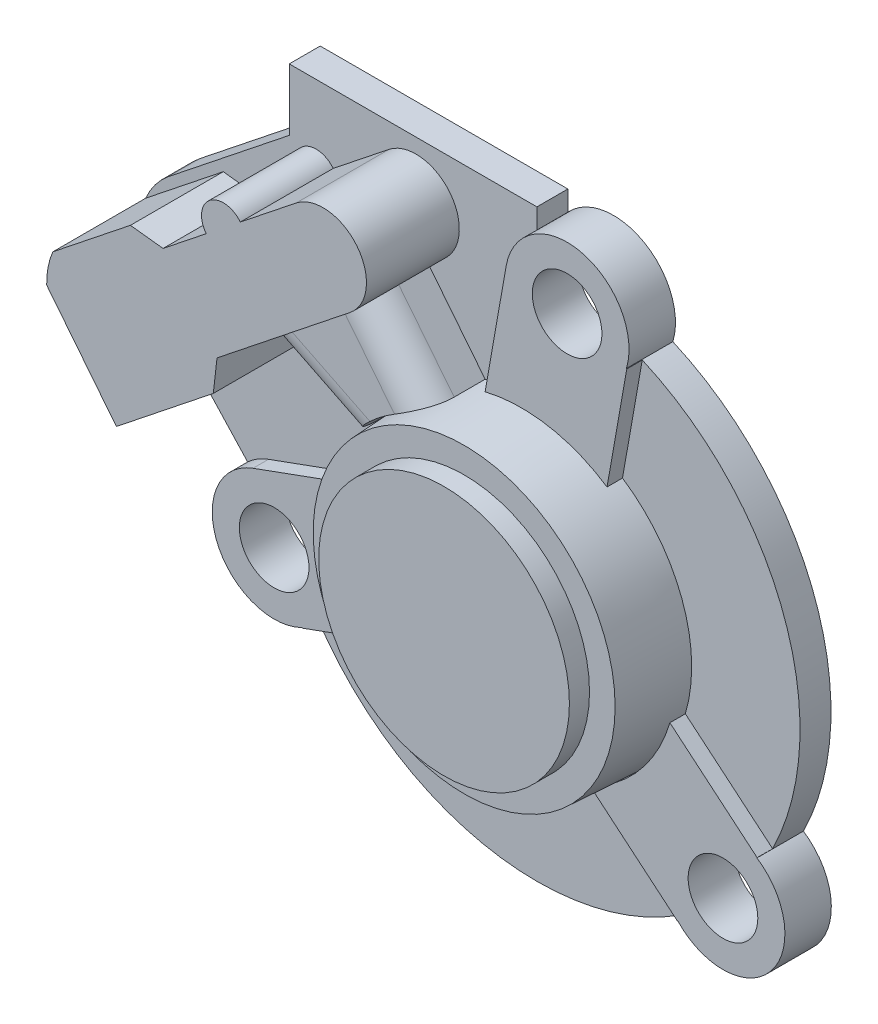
from build123d import *

# Parameters (mm, degrees)
EXTRUDE_1_DEPTH        = 2
SKETCH_2_R             = 10
EXTRUDE_2_DEPTH        = 4.7
EXTRUDE_2_TAPER        = 3
SKETCH_3_R             = 8.1
EXTRUDE_3_DEPTH        = 1.3
EXTRUDE_4_DEPTH        = 1
EXTRUDE_5_DEPTH        = 6
EXTRUDE_6_DEPTH        = 4
FILLET_1_R             = 2
HOLE_WIZARD_M4_1_D     = 4.5
HOLE_WIZARD_M4_1_DEPTH = 11.5
HOLE_WIZARD_M4_1_TIP   = 1.351936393


with BuildPart() as part:
    # Sketch 1 → Extrude 1 (new body)
    with BuildSketch(Plane.XY):
        with BuildLine():
            Line((41.455360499, 47.839069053), (47.109851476, 41.722789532))
            ThreePointArc((47.109851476, 41.722789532), (46.538829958, 36.505393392), (51.626013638, 35.213940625))
            ThreePointArc((51.626013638, 35.213940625), (62.84798098, 27.858268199), (75.908969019, 30.93220042))
            ThreePointArc((75.908969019, 30.93220042), (81.886933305, 31.101460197), (81.015559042, 37.017997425))
            ThreePointArc((81.015559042, 37.017997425), (81.774774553, 50.414342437), (72.582177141, 60.188523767))
            ThreePointArc((72.582177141, 60.188523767), (70.727622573, 64.81980463), (65.8, 64.040913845))
            Line((65.8, 64.040913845), (65.8, 65.341731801))
            Line((65.8, 65.341731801), (49.8, 65.341731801))
            Line((49.8, 65.341731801), (49.8, 61.341731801))
            Line((49.8, 61.341731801), (42.013494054, 55.145763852))
            ThreePointArc((42.013494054, 55.145763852), (40.141299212, 51.614110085), (41.455360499, 47.839069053))
        make_face()
    extrude(amount=EXTRUDE_1_DEPTH)

    # Sketch 2 → Extrude 2 (add)
    with BuildSketch(Plane.XY.offset(2)):
        with Locations((65.8, 44.6)):
            Circle(SKETCH_2_R)
    extrude(amount=EXTRUDE_2_DEPTH, taper=EXTRUDE_2_TAPER)

    # Sketch 3 → Extrude 3 (add)
    with BuildSketch(Plane.XY.offset(6.7)):
        with Locations((65.8, 44.6)):
            Circle(SKETCH_3_R)
    extrude(amount=EXTRUDE_3_DEPTH)

    # Sketch 5 → Extrude 4 (add)
    with BuildSketch(Plane.XY.offset(2)):
        with BuildLine():
            ThreePointArc((75.392063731, 41.772932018), (73.460444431, 38.172123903), (70.249762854, 35.644576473))
            Line((70.249762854, 35.644576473), (75.885981, 30.915227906))
            ThreePointArc((75.885981, 30.915227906), (75.897478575, 30.923709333), (75.908969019, 30.93220042))
            ThreePointArc((75.908969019, 30.93220042), (81.886933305, 31.101460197), (81.015559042, 37.017997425))
            ThreePointArc((81.015559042, 37.017997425), (81.021925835, 37.030787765), (81.028281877, 37.043583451))
            Line((81.028281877, 37.043583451), (75.392063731, 41.772932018))
        make_face()
        with BuildLine():
            Line((51.641810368, 35.190129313), (58.555655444, 37.706563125))
            ThreePointArc((58.555655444, 37.706563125), (56.403073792, 41.179798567), (55.819494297, 45.224104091))
            Line((55.819494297, 45.224104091), (48.457144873, 42.544428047))
            ThreePointArc((48.457144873, 42.544428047), (46.153601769, 37.19846521), (51.626013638, 35.213940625))
            ThreePointArc((51.626013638, 35.213940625), (51.633907, 35.20203165), (51.641810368, 35.190129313))
        make_face()
        with BuildLine():
            Line((64.812788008, 62.036324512), (63.452280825, 54.320504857))
            ThreePointArc((63.452280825, 54.320504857), (67.536481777, 54.44807753), (71.330742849, 52.931319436))
            Line((71.330742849, 52.931319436), (72.608369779, 60.177101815))
            ThreePointArc((72.608369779, 60.177101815), (72.59527586, 60.182818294), (72.582177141, 60.188523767))
            ThreePointArc((72.582177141, 60.188523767), (69.677527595, 65.233188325), (64.812788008, 62.036324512))
        make_face()
    extrude(amount=EXTRUDE_4_DEPTH)

    # Sketch 6 → Extrude 5 (add)
    with BuildSketch(Plane.XY.offset(2)):
        with BuildLine():
            Line((56.243547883, 63.779606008), (52.638319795, 60.910812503))
            ThreePointArc((52.638319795, 60.910812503), (50.661114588, 61.135724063), (50.436203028, 59.158518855))
            Line((50.436203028, 59.158518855), (47.645606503, 56.937953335))
            Line((47.645606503, 56.937953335), (45.537878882, 57.177712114))
            Line((45.537878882, 57.177712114), (40.525065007, 53.188858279))
            ThreePointArc((40.525065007, 53.188858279), (40.217153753, 52.179655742), (40.127877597, 51.128309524))
            Line((40.127877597, 51.128309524), (44.632759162, 45.467000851))
            Line((44.632759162, 45.467000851), (50.892722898, 50.448251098))
            Line((50.892722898, 50.448251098), (51.132481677, 52.55597872))
            Line((51.132481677, 52.55597872), (59.730423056, 59.397631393))
            ThreePointArc((59.730423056, 59.397631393), (60.177972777, 63.332056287), (56.243547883, 63.779606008))
        make_face()
    extrude(amount=EXTRUDE_5_DEPTH)

    # Sketch 8 → Extrude 6 (add)
    with BuildSketch(Plane.XY.offset(2)):
        with BuildLine():
            Line((56.589904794, 56.898622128), (59.932643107, 52.697785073))
            ThreePointArc((59.932643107, 52.697785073), (61.146580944, 53.451310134), (62.455515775, 54.024140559))
            Line((62.455515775, 54.024140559), (58.780892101, 58.642059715))
            Line((58.780892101, 58.642059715), (56.589904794, 56.898622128))
        make_face()
        with BuildLine():
            Line((51.949042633, 53.205741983), (57.644217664, 50.386468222))
            ThreePointArc((57.644217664, 50.386468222), (58.693829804, 51.6357903), (59.932643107, 52.697785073))
            Line((59.932643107, 52.697785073), (56.589904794, 56.898622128))
            Line((56.589904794, 56.898622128), (51.949042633, 53.205741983))
        make_face()
    extrude(amount=EXTRUDE_6_DEPTH)

    # Fillet 1
    fillet_1_edges = [part.edges().sort_by_distance(p)[0] for p in [
        (54.796630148, 51.796105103, 6),
        (60.618203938, 56.333100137, 6),
    ]]
    fillet(fillet_1_edges, radius=FILLET_1_R)

    # Hole Wizard M4 _1
    with Locations(Plane.XY.offset(3)):
        with Locations((68.75201902, 61.341731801), (49.825225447, 38.785657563), (78.822755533, 33.672610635)):
            Hole(HOLE_WIZARD_M4_1_D / 2, depth=HOLE_WIZARD_M4_1_DEPTH)
            with Locations((0, 0, -(HOLE_WIZARD_M4_1_DEPTH + HOLE_WIZARD_M4_1_TIP / 2))):  # 118° drill point
                Cone(0, HOLE_WIZARD_M4_1_D / 2, HOLE_WIZARD_M4_1_TIP, mode=Mode.SUBTRACT)


solid = part.part
